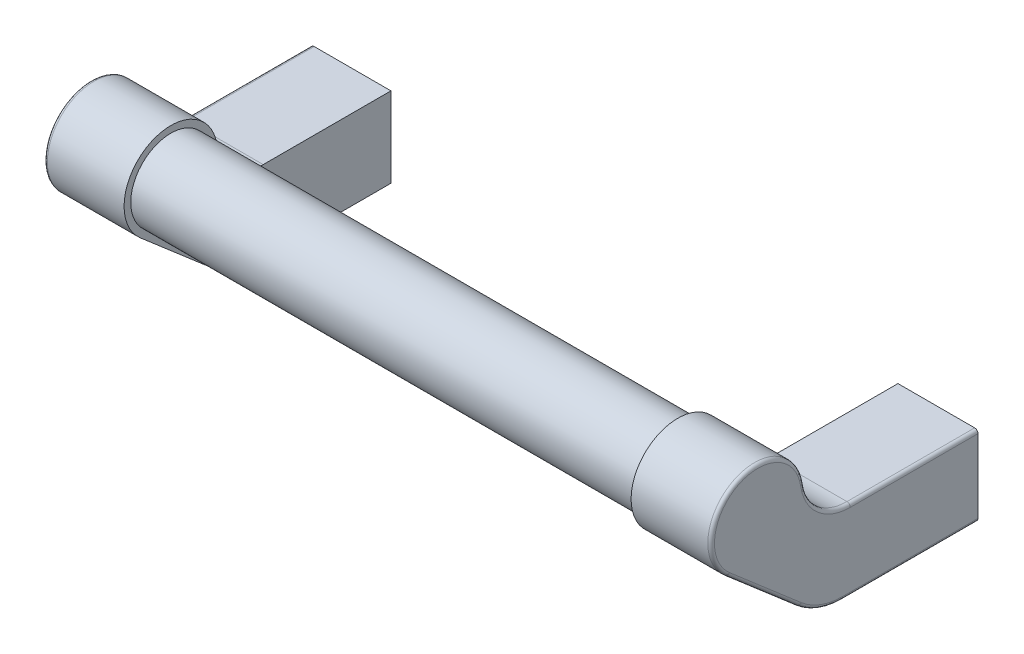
ISO-10303-21;
HEADER;
FILE_DESCRIPTION(('STEP AP214'),'2;1');
FILE_NAME('part.step','',(''),(''),'','','');
FILE_SCHEMA(('AUTOMOTIVE_DESIGN { 1 0 10303 214 1 1 1 1 }'));
ENDSEC;
DATA;
#1=APPLICATION_CONTEXT('core data for automotive mechanical design processes');
#2=APPLICATION_PROTOCOL_DEFINITION('international standard','automotive_design',2000,#1);
#3=PRODUCT_CONTEXT('',#1,'mechanical');
#4=PRODUCT('Part','Part','',(#3));
#5=PRODUCT_RELATED_PRODUCT_CATEGORY('part','',(#4));
#6=PRODUCT_DEFINITION_FORMATION('','',#4);
#7=PRODUCT_DEFINITION_CONTEXT('part definition',#1,'design');
#8=PRODUCT_DEFINITION('design','',#6,#7);
#9=PRODUCT_DEFINITION_SHAPE('','',#8);
#10=(LENGTH_UNIT() NAMED_UNIT(*) SI_UNIT(.MILLI.,.METRE.));
#11=(NAMED_UNIT(*) PLANE_ANGLE_UNIT() SI_UNIT($,.RADIAN.));
#12=(NAMED_UNIT(*) SI_UNIT($,.STERADIAN.) SOLID_ANGLE_UNIT());
#13=UNCERTAINTY_MEASURE_WITH_UNIT(LENGTH_MEASURE(1.E-05),#10,'distance_accuracy_value','');
#14=(GEOMETRIC_REPRESENTATION_CONTEXT(3) GLOBAL_UNCERTAINTY_ASSIGNED_CONTEXT((#13)) GLOBAL_UNIT_ASSIGNED_CONTEXT((#10,
#11,#12)) REPRESENTATION_CONTEXT('',''));
#15=CARTESIAN_POINT('',(0.,0.,0.));
#16=DIRECTION('',(0.,0.,1.));
#17=DIRECTION('',(1.,0.,0.));
#18=AXIS2_PLACEMENT_3D('',#15,#16,#17);
#19=CARTESIAN_POINT('',(94.,-6.,20.284802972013));
#20=DIRECTION('',(0.,1.,0.));
#21=DIRECTION('',(0.,0.,1.));
#22=AXIS2_PLACEMENT_3D('',#19,#20,#21);
#23=PLANE('',#22);
#24=DIRECTION('',(-1.,0.,0.));
#25=VECTOR('',#24,1.);
#26=CARTESIAN_POINT('',(94.,-6.,0.));
#27=LINE('',#26,#25);
#28=CARTESIAN_POINT('',(93.5,-6.,0.));
#29=VERTEX_POINT('',#28);
#30=CARTESIAN_POINT('',(82.,-6.,0.));
#31=VERTEX_POINT('',#30);
#32=EDGE_CURVE('E157',#29,#31,#27,.T.);
#33=ORIENTED_EDGE('',*,*,#32,.F.);
#34=DIRECTION('',(0.,0.,-1.));
#35=VECTOR('',#34,1.);
#36=CARTESIAN_POINT('',(93.5,-6.,20.284802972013));
#37=LINE('',#36,#35);
#38=CARTESIAN_POINT('',(93.5,-6.,20.284802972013));
#39=VERTEX_POINT('',#38);
#40=EDGE_CURVE('E29',#29,#39,#37,.F.);
#41=ORIENTED_EDGE('',*,*,#40,.T.);
#42=DIRECTION('',(-1.,0.,0.));
#43=VECTOR('',#42,1.);
#44=CARTESIAN_POINT('',(94.,-6.,20.284802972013));
#45=LINE('',#44,#43);
#46=CARTESIAN_POINT('',(82.,-6.,20.284802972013));
#47=VERTEX_POINT('',#46);
#48=EDGE_CURVE('E179',#39,#47,#45,.T.);
#49=ORIENTED_EDGE('',*,*,#48,.T.);
#50=DIRECTION('',(0.,0.,-1.));
#51=VECTOR('',#50,1.);
#52=CARTESIAN_POINT('',(82.,-6.,20.284802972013));
#53=LINE('',#52,#51);
#54=EDGE_CURVE('E174',#47,#31,#53,.T.);
#55=ORIENTED_EDGE('',*,*,#54,.T.);
#56=EDGE_LOOP('',(#33,#41,#49,#55));
#57=FACE_BOUND('',#56,.T.);
#58=ADVANCED_FACE('F14',(#57),#23,.F.);
#59=CARTESIAN_POINT('',(94.,-6.,0.));
#60=DIRECTION('',(0.,0.,1.));
#61=DIRECTION('',(1.,0.,0.));
#62=AXIS2_PLACEMENT_3D('',#59,#60,#61);
#63=PLANE('',#62);
#64=CARTESIAN_POINT('',(88.,0.,0.));
#65=DIRECTION('',(0.,0.,1.));
#66=DIRECTION('',(1.,0.,0.));
#67=AXIS2_PLACEMENT_3D('',#64,#65,#66);
#68=CIRCLE('',#67,2.4);
#69=CARTESIAN_POINT('',(90.4,0.,0.));
#70=VERTEX_POINT('',#69);
#71=EDGE_CURVE('E9',#70,#70,#68,.T.);
#72=ORIENTED_EDGE('',*,*,#71,.T.);
#73=EDGE_LOOP('',(#72));
#74=FACE_BOUND('',#73,.T.);
#75=DIRECTION('',(-1.,0.,0.));
#76=VECTOR('',#75,1.);
#77=CARTESIAN_POINT('',(94.,6.,0.));
#78=LINE('',#77,#76);
#79=CARTESIAN_POINT('',(93.5,6.,0.));
#80=VERTEX_POINT('',#79);
#81=CARTESIAN_POINT('',(82.,6.,0.));
#82=VERTEX_POINT('',#81);
#83=EDGE_CURVE('E168',#80,#82,#78,.T.);
#84=ORIENTED_EDGE('',*,*,#83,.F.);
#85=CARTESIAN_POINT('',(93.5,5.5,0.));
#86=DIRECTION('',(0.,0.,1.));
#87=DIRECTION('',(1.,0.,0.));
#88=AXIS2_PLACEMENT_3D('',#85,#86,#87);
#89=CIRCLE('',#88,0.5);
#90=CARTESIAN_POINT('',(94.,5.5,0.));
#91=VERTEX_POINT('',#90);
#92=EDGE_CURVE('E330',#80,#91,#89,.F.);
#93=ORIENTED_EDGE('',*,*,#92,.T.);
#94=DIRECTION('',(0.,1.,0.));
#95=VECTOR('',#94,1.);
#96=CARTESIAN_POINT('',(94.,-6.,0.));
#97=LINE('',#96,#95);
#98=CARTESIAN_POINT('',(94.,-5.5,0.));
#99=VERTEX_POINT('',#98);
#100=EDGE_CURVE('E187',#99,#91,#97,.T.);
#101=ORIENTED_EDGE('',*,*,#100,.F.);
#102=CARTESIAN_POINT('',(93.5,-5.5,0.));
#103=DIRECTION('',(0.,0.,1.));
#104=DIRECTION('',(1.,0.,0.));
#105=AXIS2_PLACEMENT_3D('',#102,#103,#104);
#106=CIRCLE('',#105,0.5);
#107=EDGE_CURVE('E165',#99,#29,#106,.F.);
#108=ORIENTED_EDGE('',*,*,#107,.T.);
#109=ORIENTED_EDGE('',*,*,#32,.T.);
#110=DIRECTION('',(0.,1.,0.));
#111=VECTOR('',#110,1.);
#112=CARTESIAN_POINT('',(82.,-6.,0.));
#113=LINE('',#112,#111);
#114=EDGE_CURVE('E161',#31,#82,#113,.T.);
#115=ORIENTED_EDGE('',*,*,#114,.T.);
#116=EDGE_LOOP('',(#84,#93,#101,#108,#109,#115));
#117=FACE_BOUND('',#116,.T.);
#118=ADVANCED_FACE('F160',(#74,#117),#63,.F.);
#119=CARTESIAN_POINT('',(94.,6.,0.));
#120=DIRECTION('',(0.,-1.,0.));
#121=DIRECTION('',(0.,0.,-1.));
#122=AXIS2_PLACEMENT_3D('',#119,#120,#121);
#123=PLANE('',#122);
#124=DIRECTION('',(-1.,0.,0.));
#125=VECTOR('',#124,1.);
#126=CARTESIAN_POINT('',(94.,6.,19.143593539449));
#127=LINE('',#126,#125);
#128=CARTESIAN_POINT('',(93.5,6.,19.143593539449));
#129=VERTEX_POINT('',#128);
#130=CARTESIAN_POINT('',(82.,6.,19.143593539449));
#131=VERTEX_POINT('',#130);
#132=EDGE_CURVE('E209',#129,#131,#127,.T.);
#133=ORIENTED_EDGE('',*,*,#132,.F.);
#134=DIRECTION('',(0.,0.,1.));
#135=VECTOR('',#134,1.);
#136=CARTESIAN_POINT('',(93.5,6.,0.));
#137=LINE('',#136,#135);
#138=EDGE_CURVE('E327',#129,#80,#137,.F.);
#139=ORIENTED_EDGE('',*,*,#138,.T.);
#140=ORIENTED_EDGE('',*,*,#83,.T.);
#141=DIRECTION('',(0.,0.,1.));
#142=VECTOR('',#141,1.);
#143=CARTESIAN_POINT('',(82.,6.,0.));
#144=LINE('',#143,#142);
#145=EDGE_CURVE('E177',#82,#131,#144,.T.);
#146=ORIENTED_EDGE('',*,*,#145,.T.);
#147=EDGE_LOOP('',(#133,#139,#140,#146));
#148=FACE_BOUND('',#147,.T.);
#149=ADVANCED_FACE('F371',(#148),#123,.F.);
#150=CARTESIAN_POINT('',(94.,13.,19.143593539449));
#151=DIRECTION('',(-1.,0.,0.));
#152=DIRECTION('',(0.,0.,1.));
#153=AXIS2_PLACEMENT_3D('',#150,#151,#152);
#154=CYLINDRICAL_SURFACE('',#153,7.);
#155=DIRECTION('',(-1.,0.,0.));
#156=VECTOR('',#155,1.);
#157=CARTESIAN_POINT('',(94.,12.,26.0717967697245));
#158=LINE('',#157,#156);
#159=CARTESIAN_POINT('',(93.5,12.,26.0717967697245));
#160=VERTEX_POINT('',#159);
#161=CARTESIAN_POINT('',(82.,12.,26.0717967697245));
#162=VERTEX_POINT('',#161);
#163=EDGE_CURVE('E207',#160,#162,#158,.T.);
#164=ORIENTED_EDGE('',*,*,#163,.F.);
#165=CARTESIAN_POINT('',(93.5,13.,19.143593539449));
#166=DIRECTION('',(1.,0.,0.));
#167=DIRECTION('',(0.,0.,-1.));
#168=AXIS2_PLACEMENT_3D('',#165,#166,#167);
#169=CIRCLE('',#168,7.);
#170=EDGE_CURVE('E332',#160,#129,#169,.T.);
#171=ORIENTED_EDGE('',*,*,#170,.T.);
#172=ORIENTED_EDGE('',*,*,#132,.T.);
#173=CARTESIAN_POINT('',(82.,13.,19.143593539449));
#174=DIRECTION('',(-1.,0.,0.));
#175=DIRECTION('',(0.,0.,-1.));
#176=AXIS2_PLACEMENT_3D('',#173,#174,#175);
#177=CIRCLE('',#176,7.);
#178=EDGE_CURVE('E191',#131,#162,#177,.T.);
#179=ORIENTED_EDGE('',*,*,#178,.T.);
#180=EDGE_LOOP('',(#164,#171,#172,#179));
#181=FACE_BOUND('',#180,.T.);
#182=ADVANCED_FACE('F606',(#181),#154,.F.);
#183=CARTESIAN_POINT('',(94.,11.,33.));
#184=DIRECTION('',(-1.,0.,0.));
#185=DIRECTION('',(0.,0.,1.));
#186=AXIS2_PLACEMENT_3D('',#183,#184,#185);
#187=CYLINDRICAL_SURFACE('',#186,7.);
#188=DIRECTION('',(-1.,0.,0.));
#189=VECTOR('',#188,1.);
#190=CARTESIAN_POINT('',(94.,5.69800597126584,37.5704331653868));
#191=LINE('',#190,#189);
#192=CARTESIAN_POINT('',(93.5,5.69800597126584,37.5704331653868));
#193=VERTEX_POINT('',#192);
#194=CARTESIAN_POINT('',(82.,5.69800597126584,37.5704331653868));
#195=VERTEX_POINT('',#194);
#196=EDGE_CURVE('E205',#193,#195,#191,.T.);
#197=ORIENTED_EDGE('',*,*,#196,.F.);
#198=CARTESIAN_POINT('',(93.5,11.,33.));
#199=DIRECTION('',(1.,0.,0.));
#200=DIRECTION('',(0.,0.,-1.));
#201=AXIS2_PLACEMENT_3D('',#198,#199,#200);
#202=CIRCLE('',#201,7.);
#203=EDGE_CURVE('E334',#193,#160,#202,.F.);
#204=ORIENTED_EDGE('',*,*,#203,.T.);
#205=ORIENTED_EDGE('',*,*,#163,.T.);
#206=CARTESIAN_POINT('',(82.,11.,33.));
#207=DIRECTION('',(1.,0.,0.));
#208=DIRECTION('',(0.,0.,-1.));
#209=AXIS2_PLACEMENT_3D('',#206,#207,#208);
#210=CIRCLE('',#209,7.);
#211=EDGE_CURVE('E194',#162,#195,#210,.T.);
#212=ORIENTED_EDGE('',*,*,#211,.T.);
#213=EDGE_LOOP('',(#197,#204,#205,#212));
#214=FACE_BOUND('',#213,.T.);
#215=ADVANCED_FACE('F598',(#214),#187,.T.);
#216=CARTESIAN_POINT('',(94.,5.69800597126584,37.5704331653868));
#217=DIRECTION('',(0.,0.757427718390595,-0.65291902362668));
#218=DIRECTION('',(0.,0.65291902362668,0.757427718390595));
#219=AXIS2_PLACEMENT_3D('',#216,#217,#218);
#220=PLANE('',#219);
#221=DIRECTION('',(-1.,0.,0.));
#222=VECTOR('',#221,1.);
#223=CARTESIAN_POINT('',(94.,-3.57427718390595,26.8139932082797));
#224=LINE('',#223,#222);
#225=CARTESIAN_POINT('',(93.5,-3.57427718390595,26.8139932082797));
#226=VERTEX_POINT('',#225);
#227=CARTESIAN_POINT('',(82.,-3.57427718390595,26.8139932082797));
#228=VERTEX_POINT('',#227);
#229=EDGE_CURVE('E203',#226,#228,#224,.T.);
#230=ORIENTED_EDGE('',*,*,#229,.F.);
#231=DIRECTION('',(0.,-0.65291902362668,-0.757427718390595));
#232=VECTOR('',#231,1.);
#233=CARTESIAN_POINT('',(93.5,5.69800597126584,37.5704331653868));
#234=LINE('',#233,#232);
#235=EDGE_CURVE('E336',#226,#193,#234,.F.);
#236=ORIENTED_EDGE('',*,*,#235,.T.);
#237=ORIENTED_EDGE('',*,*,#196,.T.);
#238=DIRECTION('',(0.,-0.65291902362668,-0.757427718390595));
#239=VECTOR('',#238,1.);
#240=CARTESIAN_POINT('',(82.,5.69800597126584,37.5704331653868));
#241=LINE('',#240,#239);
#242=EDGE_CURVE('E197',#195,#228,#241,.T.);
#243=ORIENTED_EDGE('',*,*,#242,.T.);
#244=EDGE_LOOP('',(#230,#236,#237,#243));
#245=FACE_BOUND('',#244,.T.);
#246=ADVANCED_FACE('F591',(#245),#220,.F.);
#247=CARTESIAN_POINT('',(94.,4.,20.284802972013));
#248=DIRECTION('',(-1.,0.,0.));
#249=DIRECTION('',(0.,0.,1.));
#250=AXIS2_PLACEMENT_3D('',#247,#248,#249);
#251=CYLINDRICAL_SURFACE('',#250,10.);
#252=ORIENTED_EDGE('',*,*,#48,.F.);
#253=CARTESIAN_POINT('',(93.5,4.,20.284802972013));
#254=DIRECTION('',(1.,0.,0.));
#255=DIRECTION('',(0.,0.,-1.));
#256=AXIS2_PLACEMENT_3D('',#253,#254,#255);
#257=CIRCLE('',#256,10.);
#258=EDGE_CURVE('E36',#39,#226,#257,.F.);
#259=ORIENTED_EDGE('',*,*,#258,.T.);
#260=ORIENTED_EDGE('',*,*,#229,.T.);
#261=CARTESIAN_POINT('',(82.,4.,20.284802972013));
#262=DIRECTION('',(1.,0.,0.));
#263=DIRECTION('',(0.,0.,-1.));
#264=AXIS2_PLACEMENT_3D('',#261,#262,#263);
#265=CIRCLE('',#264,10.);
#266=EDGE_CURVE('E200',#228,#47,#265,.T.);
#267=ORIENTED_EDGE('',*,*,#266,.T.);
#268=EDGE_LOOP('',(#252,#259,#260,#267));
#269=FACE_BOUND('',#268,.T.);
#270=ADVANCED_FACE('F583',(#269),#251,.T.);
#271=CARTESIAN_POINT('',(94.,13.,19.143593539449));
#272=DIRECTION('',(1.,0.,0.));
#273=DIRECTION('',(0.,0.,-1.));
#274=AXIS2_PLACEMENT_3D('',#271,#272,#273);
#275=PLANE('',#274);
#276=ORIENTED_EDGE('',*,*,#100,.T.);
#277=DIRECTION('',(0.,0.,1.));
#278=VECTOR('',#277,1.);
#279=CARTESIAN_POINT('',(94.,5.5,19.143593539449));
#280=LINE('',#279,#278);
#281=CARTESIAN_POINT('',(94.,5.5,19.143593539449));
#282=VERTEX_POINT('',#281);
#283=EDGE_CURVE('E324',#91,#282,#280,.T.);
#284=ORIENTED_EDGE('',*,*,#283,.T.);
#285=CARTESIAN_POINT('',(94.,13.,19.143593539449));
#286=DIRECTION('',(1.,0.,0.));
#287=DIRECTION('',(0.,0.,-1.));
#288=AXIS2_PLACEMENT_3D('',#285,#286,#287);
#289=CIRCLE('',#288,7.5);
#290=CARTESIAN_POINT('',(94.,11.9285714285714,26.5666684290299));
#291=VERTEX_POINT('',#290);
#292=EDGE_CURVE('E322',#282,#291,#289,.F.);
#293=ORIENTED_EDGE('',*,*,#292,.T.);
#294=CARTESIAN_POINT('',(94.,11.,33.));
#295=DIRECTION('',(1.,0.,0.));
#296=DIRECTION('',(0.,0.,-1.));
#297=AXIS2_PLACEMENT_3D('',#294,#295,#296);
#298=CIRCLE('',#297,6.5);
#299=CARTESIAN_POINT('',(94.,6.07671983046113,37.2439736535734));
#300=VERTEX_POINT('',#299);
#301=EDGE_CURVE('E320',#291,#300,#298,.T.);
#302=ORIENTED_EDGE('',*,*,#301,.T.);
#303=DIRECTION('',(0.,-0.65291902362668,-0.757427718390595));
#304=VECTOR('',#303,1.);
#305=CARTESIAN_POINT('',(94.,-3.19556332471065,26.4875336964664));
#306=LINE('',#305,#304);
#307=CARTESIAN_POINT('',(94.,-3.19556332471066,26.4875336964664));
#308=VERTEX_POINT('',#307);
#309=EDGE_CURVE('E318',#300,#308,#306,.T.);
#310=ORIENTED_EDGE('',*,*,#309,.T.);
#311=CARTESIAN_POINT('',(94.,4.,20.284802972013));
#312=DIRECTION('',(1.,0.,0.));
#313=DIRECTION('',(0.,0.,-1.));
#314=AXIS2_PLACEMENT_3D('',#311,#312,#313);
#315=CIRCLE('',#314,9.5);
#316=CARTESIAN_POINT('',(94.,-5.5,20.284802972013));
#317=VERTEX_POINT('',#316);
#318=EDGE_CURVE('E316',#308,#317,#315,.T.);
#319=ORIENTED_EDGE('',*,*,#318,.T.);
#320=DIRECTION('',(0.,0.,-1.));
#321=VECTOR('',#320,1.);
#322=CARTESIAN_POINT('',(94.,-5.5,0.));
#323=LINE('',#322,#321);
#324=EDGE_CURVE('E312',#317,#99,#323,.T.);
#325=ORIENTED_EDGE('',*,*,#324,.T.);
#326=EDGE_LOOP('',(#276,#284,#293,#302,#310,#319,#325));
#327=FACE_BOUND('',#326,.T.);
#328=ADVANCED_FACE('F575',(#327),#275,.T.);
#329=CARTESIAN_POINT('',(82.,13.,19.143593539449));
#330=DIRECTION('',(1.,0.,0.));
#331=DIRECTION('',(0.,0.,-1.));
#332=AXIS2_PLACEMENT_3D('',#329,#330,#331);
#333=PLANE('',#332);
#334=CARTESIAN_POINT('',(82.,11.,33.));
#335=DIRECTION('',(1.,0.,0.));
#336=DIRECTION('',(0.,0.,-1.));
#337=AXIS2_PLACEMENT_3D('',#334,#335,#336);
#338=CIRCLE('',#337,6.);
#339=CARTESIAN_POINT('',(82.,11.,27.));
#340=VERTEX_POINT('',#339);
#341=EDGE_CURVE('E167',#340,#340,#338,.F.);
#342=ORIENTED_EDGE('',*,*,#341,.F.);
#343=EDGE_LOOP('',(#342));
#344=FACE_BOUND('',#343,.T.);
#345=ORIENTED_EDGE('',*,*,#54,.F.);
#346=ORIENTED_EDGE('',*,*,#266,.F.);
#347=ORIENTED_EDGE('',*,*,#242,.F.);
#348=ORIENTED_EDGE('',*,*,#211,.F.);
#349=ORIENTED_EDGE('',*,*,#178,.F.);
#350=ORIENTED_EDGE('',*,*,#145,.F.);
#351=ORIENTED_EDGE('',*,*,#114,.F.);
#352=EDGE_LOOP('',(#345,#346,#347,#348,#349,#350,#351));
#353=FACE_BOUND('',#352,.T.);
#354=ADVANCED_FACE('F172',(#344,#353),#333,.F.);
#355=CARTESIAN_POINT('',(0.,0.,6.));
#356=DIRECTION('',(0.,0.,-1.));
#357=DIRECTION('',(-1.,0.,0.));
#358=AXIS2_PLACEMENT_3D('',#355,#356,#357);
#359=PLANE('',#358);
#360=CARTESIAN_POINT('',(0.,0.,6.));
#361=DIRECTION('',(0.,0.,-1.));
#362=DIRECTION('',(-1.,0.,0.));
#363=AXIS2_PLACEMENT_3D('',#360,#361,#362);
#364=CIRCLE('',#363,2.);
#365=CARTESIAN_POINT('',(-2.,0.,6.));
#366=VERTEX_POINT('',#365);
#367=EDGE_CURVE('E218',#366,#366,#364,.T.);
#368=ORIENTED_EDGE('',*,*,#367,.T.);
#369=EDGE_LOOP('',(#368));
#370=FACE_BOUND('',#369,.T.);
#371=ADVANCED_FACE('F560',(#370),#359,.T.);
#372=CARTESIAN_POINT('',(0.,0.,6.));
#373=DIRECTION('',(0.,0.,-1.));
#374=DIRECTION('',(-1.,0.,0.));
#375=AXIS2_PLACEMENT_3D('',#372,#373,#374);
#376=CYLINDRICAL_SURFACE('',#375,2.);
#377=CARTESIAN_POINT('',(0.,0.,0.4));
#378=DIRECTION('',(0.,0.,1.));
#379=DIRECTION('',(1.,0.,0.));
#380=AXIS2_PLACEMENT_3D('',#377,#378,#379);
#381=CIRCLE('',#380,2.);
#382=CARTESIAN_POINT('',(2.,0.,0.4));
#383=VERTEX_POINT('',#382);
#384=EDGE_CURVE('E306',#383,#383,#381,.F.);
#385=ORIENTED_EDGE('',*,*,#384,.T.);
#386=EDGE_LOOP('',(#385));
#387=FACE_BOUND('',#386,.T.);
#388=ORIENTED_EDGE('',*,*,#367,.F.);
#389=EDGE_LOOP('',(#388));
#390=FACE_BOUND('',#389,.T.);
#391=ADVANCED_FACE('F475',(#387,#390),#376,.F.);
#392=CARTESIAN_POINT('',(-5.5,4.,20.284802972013));
#393=DIRECTION('',(-1.,0.,0.));
#394=DIRECTION('',(0.,-1.,0.));
#395=AXIS2_PLACEMENT_3D('',#392,#393,#394);
#396=TOROIDAL_SURFACE('',#395,9.5,0.5);
#397=CARTESIAN_POINT('',(-5.5,-3.19556332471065,26.4875336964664));
#398=DIRECTION('',(0.,0.65291902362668,0.757427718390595));
#399=DIRECTION('',(0.,-0.757427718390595,0.65291902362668));
#400=AXIS2_PLACEMENT_3D('',#397,#398,#399);
#401=CIRCLE('',#400,0.5);
#402=CARTESIAN_POINT('',(-6.,-3.19556332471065,26.4875336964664));
#403=VERTEX_POINT('',#402);
#404=CARTESIAN_POINT('',(-5.5,-3.57427718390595,26.8139932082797));
#405=VERTEX_POINT('',#404);
#406=EDGE_CURVE('E260',#403,#405,#401,.T.);
#407=ORIENTED_EDGE('',*,*,#406,.F.);
#408=CARTESIAN_POINT('',(-6.,4.,20.284802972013));
#409=DIRECTION('',(1.,0.,0.));
#410=DIRECTION('',(0.,-0.757427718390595,0.65291902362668));
#411=AXIS2_PLACEMENT_3D('',#408,#409,#410);
#412=CIRCLE('',#411,9.50000000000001);
#413=CARTESIAN_POINT('',(-6.,-5.5,20.284802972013));
#414=VERTEX_POINT('',#413);
#415=EDGE_CURVE('E406',#414,#403,#412,.F.);
#416=ORIENTED_EDGE('',*,*,#415,.F.);
#417=CARTESIAN_POINT('',(-5.5,-5.5,20.284802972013));
#418=DIRECTION('',(0.,0.,1.));
#419=DIRECTION('',(0.,-1.,0.));
#420=AXIS2_PLACEMENT_3D('',#417,#418,#419);
#421=CIRCLE('',#420,0.5);
#422=CARTESIAN_POINT('',(-5.5,-6.,20.284802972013));
#423=VERTEX_POINT('',#422);
#424=EDGE_CURVE('E254',#414,#423,#421,.T.);
#425=ORIENTED_EDGE('',*,*,#424,.T.);
#426=CARTESIAN_POINT('',(-5.5,4.,20.284802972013));
#427=DIRECTION('',(-1.,0.,0.));
#428=DIRECTION('',(0.,-1.,0.));
#429=AXIS2_PLACEMENT_3D('',#426,#427,#428);
#430=CIRCLE('',#429,10.);
#431=EDGE_CURVE('E257',#423,#405,#430,.T.);
#432=ORIENTED_EDGE('',*,*,#431,.T.);
#433=EDGE_LOOP('',(#407,#416,#425,#432));
#434=FACE_BOUND('',#433,.T.);
#435=ADVANCED_FACE('F464',(#434),#396,.T.);
#436=CARTESIAN_POINT('',(-5.5,-3.19556332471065,26.4875336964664));
#437=DIRECTION('',(0.,0.65291902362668,0.757427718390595));
#438=DIRECTION('',(0.,-0.757427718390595,0.65291902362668));
#439=AXIS2_PLACEMENT_3D('',#436,#437,#438);
#440=CYLINDRICAL_SURFACE('',#439,0.5);
#441=CARTESIAN_POINT('',(-5.5,6.07671983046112,37.2439736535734));
#442=DIRECTION('',(0.,0.652919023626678,0.757427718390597));
#443=DIRECTION('',(0.,-0.757427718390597,0.652919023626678));
#444=AXIS2_PLACEMENT_3D('',#441,#442,#443);
#445=CIRCLE('',#444,0.5);
#446=CARTESIAN_POINT('',(-6.,6.07671983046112,37.2439736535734));
#447=VERTEX_POINT('',#446);
#448=CARTESIAN_POINT('',(-5.5,5.69800597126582,37.5704331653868));
#449=VERTEX_POINT('',#448);
#450=EDGE_CURVE('E266',#447,#449,#445,.T.);
#451=ORIENTED_EDGE('',*,*,#450,.F.);
#452=DIRECTION('',(0.,0.65291902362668,0.757427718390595));
#453=VECTOR('',#452,1.);
#454=CARTESIAN_POINT('',(-6.,-3.19556332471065,26.4875336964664));
#455=LINE('',#454,#453);
#456=EDGE_CURVE('E408',#403,#447,#455,.T.);
#457=ORIENTED_EDGE('',*,*,#456,.F.);
#458=ORIENTED_EDGE('',*,*,#406,.T.);
#459=DIRECTION('',(0.,0.65291902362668,0.757427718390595));
#460=VECTOR('',#459,1.);
#461=CARTESIAN_POINT('',(-5.5,-3.57427718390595,26.8139932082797));
#462=LINE('',#461,#460);
#463=EDGE_CURVE('E263',#405,#449,#462,.T.);
#464=ORIENTED_EDGE('',*,*,#463,.T.);
#465=EDGE_LOOP('',(#451,#457,#458,#464));
#466=FACE_BOUND('',#465,.T.);
#467=ADVANCED_FACE('F474',(#466),#440,.T.);
#468=CARTESIAN_POINT('',(-5.5,11.,33.));
#469=DIRECTION('',(-1.,0.,0.));
#470=DIRECTION('',(0.,-1.,0.));
#471=AXIS2_PLACEMENT_3D('',#468,#469,#470);
#472=TOROIDAL_SURFACE('',#471,6.5,0.5);
#473=CARTESIAN_POINT('',(-5.5,11.9285714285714,26.5666684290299));
#474=DIRECTION('',(0.,-0.989743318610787,-0.142857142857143));
#475=DIRECTION('',(0.,0.142857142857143,-0.989743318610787));
#476=AXIS2_PLACEMENT_3D('',#473,#474,#475);
#477=CIRCLE('',#476,0.5);
#478=CARTESIAN_POINT('',(-5.5,12.,26.0717967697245));
#479=VERTEX_POINT('',#478);
#480=CARTESIAN_POINT('',(-6.,11.9285714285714,26.5666684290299));
#481=VERTEX_POINT('',#480);
#482=EDGE_CURVE('E274',#479,#481,#477,.F.);
#483=ORIENTED_EDGE('',*,*,#482,.T.);
#484=CARTESIAN_POINT('',(-6.,11.,33.));
#485=DIRECTION('',(1.,0.,0.));
#486=DIRECTION('',(0.,0.142857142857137,-0.989743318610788));
#487=AXIS2_PLACEMENT_3D('',#484,#485,#486);
#488=CIRCLE('',#487,6.50000000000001);
#489=EDGE_CURVE('E215',#447,#481,#488,.F.);
#490=ORIENTED_EDGE('',*,*,#489,.F.);
#491=ORIENTED_EDGE('',*,*,#450,.T.);
#492=CARTESIAN_POINT('',(-5.5,11.,33.));
#493=DIRECTION('',(-1.,0.,0.));
#494=DIRECTION('',(0.,-1.,0.));
#495=AXIS2_PLACEMENT_3D('',#492,#493,#494);
#496=CIRCLE('',#495,7.);
#497=EDGE_CURVE('E271',#449,#479,#496,.T.);
#498=ORIENTED_EDGE('',*,*,#497,.T.);
#499=EDGE_LOOP('',(#483,#490,#491,#498));
#500=FACE_BOUND('',#499,.T.);
#501=ADVANCED_FACE('F294',(#500),#472,.T.);
#502=CARTESIAN_POINT('',(-5.5,13.,19.143593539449));
#503=DIRECTION('',(-1.,0.,0.));
#504=DIRECTION('',(0.,-1.,0.));
#505=AXIS2_PLACEMENT_3D('',#502,#503,#504);
#506=TOROIDAL_SURFACE('',#505,7.5,0.5);
#507=CARTESIAN_POINT('',(-5.5,5.5,19.143593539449));
#508=DIRECTION('',(0.,0.,-1.));
#509=DIRECTION('',(-1.,0.,0.));
#510=AXIS2_PLACEMENT_3D('',#507,#508,#509);
#511=CIRCLE('',#510,0.5);
#512=CARTESIAN_POINT('',(-6.,5.5,19.143593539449));
#513=VERTEX_POINT('',#512);
#514=CARTESIAN_POINT('',(-5.5,6.,19.143593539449));
#515=VERTEX_POINT('',#514);
#516=EDGE_CURVE('E251',#513,#515,#511,.T.);
#517=ORIENTED_EDGE('',*,*,#516,.F.);
#518=CARTESIAN_POINT('',(-6.,13.,19.143593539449));
#519=DIRECTION('',(-1.,0.,0.));
#520=DIRECTION('',(0.,-1.,0.));
#521=AXIS2_PLACEMENT_3D('',#518,#519,#520);
#522=CIRCLE('',#521,7.5);
#523=EDGE_CURVE('E433',#481,#513,#522,.F.);
#524=ORIENTED_EDGE('',*,*,#523,.F.);
#525=ORIENTED_EDGE('',*,*,#482,.F.);
#526=CARTESIAN_POINT('',(-5.5,13.,19.143593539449));
#527=DIRECTION('',(-1.,0.,0.));
#528=DIRECTION('',(0.,-1.,0.));
#529=AXIS2_PLACEMENT_3D('',#526,#527,#528);
#530=CIRCLE('',#529,7.);
#531=EDGE_CURVE('E229',#479,#515,#530,.F.);
#532=ORIENTED_EDGE('',*,*,#531,.T.);
#533=EDGE_LOOP('',(#517,#524,#525,#532));
#534=FACE_BOUND('',#533,.T.);
#535=ADVANCED_FACE('F282',(#534),#506,.T.);
#536=CARTESIAN_POINT('',(-6.,13.,19.143593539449));
#537=DIRECTION('',(-1.,0.,0.));
#538=DIRECTION('',(0.,-1.,0.));
#539=AXIS2_PLACEMENT_3D('',#536,#537,#538);
#540=PLANE('',#539);
#541=ORIENTED_EDGE('',*,*,#456,.T.);
#542=ORIENTED_EDGE('',*,*,#489,.T.);
#543=ORIENTED_EDGE('',*,*,#523,.T.);
#544=DIRECTION('',(0.,0.,1.));
#545=VECTOR('',#544,1.);
#546=CARTESIAN_POINT('',(-6.,5.5,19.143593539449));
#547=LINE('',#546,#545);
#548=CARTESIAN_POINT('',(-6.,5.5,0.));
#549=VERTEX_POINT('',#548);
#550=EDGE_CURVE('E430',#513,#549,#547,.F.);
#551=ORIENTED_EDGE('',*,*,#550,.T.);
#552=DIRECTION('',(0.,-1.,0.));
#553=VECTOR('',#552,1.);
#554=CARTESIAN_POINT('',(-6.,13.,0.));
#555=LINE('',#554,#553);
#556=CARTESIAN_POINT('',(-6.,-5.5,0.));
#557=VERTEX_POINT('',#556);
#558=EDGE_CURVE('E415',#549,#557,#555,.T.);
#559=ORIENTED_EDGE('',*,*,#558,.T.);
#560=DIRECTION('',(0.,0.,1.));
#561=VECTOR('',#560,1.);
#562=CARTESIAN_POINT('',(-6.,-5.5,19.143593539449));
#563=LINE('',#562,#561);
#564=EDGE_CURVE('E411',#557,#414,#563,.T.);
#565=ORIENTED_EDGE('',*,*,#564,.T.);
#566=ORIENTED_EDGE('',*,*,#415,.T.);
#567=EDGE_LOOP('',(#541,#542,#543,#551,#559,#565,#566));
#568=FACE_BOUND('',#567,.T.);
#569=ADVANCED_FACE('F293',(#568),#540,.T.);
#570=CARTESIAN_POINT('',(-5.5,-5.5,20.284802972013));
#571=DIRECTION('',(0.,0.,1.));
#572=DIRECTION('',(1.,0.,0.));
#573=AXIS2_PLACEMENT_3D('',#570,#571,#572);
#574=CYLINDRICAL_SURFACE('',#573,0.5);
#575=ORIENTED_EDGE('',*,*,#424,.F.);
#576=ORIENTED_EDGE('',*,*,#564,.F.);
#577=CARTESIAN_POINT('',(-5.5,-5.5,0.));
#578=DIRECTION('',(0.,0.,1.));
#579=DIRECTION('',(1.,0.,0.));
#580=AXIS2_PLACEMENT_3D('',#577,#578,#579);
#581=CIRCLE('',#580,0.5);
#582=CARTESIAN_POINT('',(-5.5,-6.,0.));
#583=VERTEX_POINT('',#582);
#584=EDGE_CURVE('E233',#557,#583,#581,.T.);
#585=ORIENTED_EDGE('',*,*,#584,.T.);
#586=DIRECTION('',(0.,0.,1.));
#587=VECTOR('',#586,1.);
#588=CARTESIAN_POINT('',(-5.5,-6.,20.284802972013));
#589=LINE('',#588,#587);
#590=EDGE_CURVE('E236',#583,#423,#589,.T.);
#591=ORIENTED_EDGE('',*,*,#590,.T.);
#592=EDGE_LOOP('',(#575,#576,#585,#591));
#593=FACE_BOUND('',#592,.T.);
#594=ADVANCED_FACE('F379',(#593),#574,.T.);
#595=CARTESIAN_POINT('',(-5.5,5.5,0.));
#596=DIRECTION('',(0.,0.,-1.));
#597=DIRECTION('',(-1.,0.,0.));
#598=AXIS2_PLACEMENT_3D('',#595,#596,#597);
#599=CYLINDRICAL_SURFACE('',#598,0.5);
#600=ORIENTED_EDGE('',*,*,#516,.T.);
#601=DIRECTION('',(0.,0.,-1.));
#602=VECTOR('',#601,1.);
#603=CARTESIAN_POINT('',(-5.5,6.,0.));
#604=LINE('',#603,#602);
#605=CARTESIAN_POINT('',(-5.5,6.,0.));
#606=VERTEX_POINT('',#605);
#607=EDGE_CURVE('E248',#515,#606,#604,.T.);
#608=ORIENTED_EDGE('',*,*,#607,.T.);
#609=CARTESIAN_POINT('',(-5.5,5.5,0.));
#610=DIRECTION('',(0.,0.,-1.));
#611=DIRECTION('',(-1.,0.,0.));
#612=AXIS2_PLACEMENT_3D('',#609,#610,#611);
#613=CIRCLE('',#612,0.5);
#614=EDGE_CURVE('E230',#606,#549,#613,.F.);
#615=ORIENTED_EDGE('',*,*,#614,.T.);
#616=ORIENTED_EDGE('',*,*,#550,.F.);
#617=EDGE_LOOP('',(#600,#608,#615,#616));
#618=FACE_BOUND('',#617,.T.);
#619=ADVANCED_FACE('F296',(#618),#599,.T.);
#620=CARTESIAN_POINT('',(0.,0.,0.4));
#621=DIRECTION('',(0.,0.,-1.));
#622=DIRECTION('',(-1.,0.,0.));
#623=AXIS2_PLACEMENT_3D('',#620,#621,#622);
#624=CONICAL_SURFACE('',#623,2.,0.785398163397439);
#625=CARTESIAN_POINT('',(0.,0.,0.));
#626=DIRECTION('',(0.,0.,1.));
#627=DIRECTION('',(1.,0.,0.));
#628=AXIS2_PLACEMENT_3D('',#625,#626,#627);
#629=CIRCLE('',#628,2.4);
#630=CARTESIAN_POINT('',(2.4,0.,0.));
#631=VERTEX_POINT('',#630);
#632=EDGE_CURVE('E309',#631,#631,#629,.T.);
#633=ORIENTED_EDGE('',*,*,#632,.F.);
#634=EDGE_LOOP('',(#633));
#635=FACE_BOUND('',#634,.T.);
#636=ORIENTED_EDGE('',*,*,#384,.F.);
#637=EDGE_LOOP('',(#636));
#638=FACE_BOUND('',#637,.T.);
#639=ADVANCED_FACE('F521',(#635,#638),#624,.F.);
#640=CARTESIAN_POINT('',(6.,-6.,20.284802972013));
#641=DIRECTION('',(0.,1.,0.));
#642=DIRECTION('',(-1.,0.,0.));
#643=AXIS2_PLACEMENT_3D('',#640,#641,#642);
#644=PLANE('',#643);
#645=ORIENTED_EDGE('',*,*,#590,.F.);
#646=DIRECTION('',(1.,0.,0.));
#647=VECTOR('',#646,1.);
#648=CARTESIAN_POINT('',(6.,-6.,0.));
#649=LINE('',#648,#647);
#650=CARTESIAN_POINT('',(6.,-6.,0.));
#651=VERTEX_POINT('',#650);
#652=EDGE_CURVE('E245',#583,#651,#649,.T.);
#653=ORIENTED_EDGE('',*,*,#652,.T.);
#654=DIRECTION('',(0.,0.,1.));
#655=VECTOR('',#654,1.);
#656=CARTESIAN_POINT('',(6.,-6.,20.284802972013));
#657=LINE('',#656,#655);
#658=CARTESIAN_POINT('',(6.,-6.,20.284802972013));
#659=VERTEX_POINT('',#658);
#660=EDGE_CURVE('E241',#659,#651,#657,.F.);
#661=ORIENTED_EDGE('',*,*,#660,.F.);
#662=DIRECTION('',(-1.,0.,0.));
#663=VECTOR('',#662,1.);
#664=CARTESIAN_POINT('',(6.,-6.,20.284802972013));
#665=LINE('',#664,#663);
#666=EDGE_CURVE('E223',#423,#659,#665,.F.);
#667=ORIENTED_EDGE('',*,*,#666,.F.);
#668=EDGE_LOOP('',(#645,#653,#661,#667));
#669=FACE_BOUND('',#668,.T.);
#670=ADVANCED_FACE('F482',(#669),#644,.F.);
#671=CARTESIAN_POINT('',(6.,4.,20.284802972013));
#672=DIRECTION('',(-1.,0.,0.));
#673=DIRECTION('',(0.,-1.,0.));
#674=AXIS2_PLACEMENT_3D('',#671,#672,#673);
#675=CYLINDRICAL_SURFACE('',#674,10.);
#676=ORIENTED_EDGE('',*,*,#666,.T.);
#677=CARTESIAN_POINT('',(6.,4.,20.284802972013));
#678=DIRECTION('',(-1.,0.,0.));
#679=DIRECTION('',(0.,-1.,0.));
#680=AXIS2_PLACEMENT_3D('',#677,#678,#679);
#681=CIRCLE('',#680,10.);
#682=CARTESIAN_POINT('',(6.,-3.57427718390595,26.8139932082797));
#683=VERTEX_POINT('',#682);
#684=EDGE_CURVE('E220',#659,#683,#681,.T.);
#685=ORIENTED_EDGE('',*,*,#684,.T.);
#686=DIRECTION('',(1.,0.,0.));
#687=VECTOR('',#686,1.);
#688=CARTESIAN_POINT('',(6.,-3.57427718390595,26.8139932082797));
#689=LINE('',#688,#687);
#690=EDGE_CURVE('E238',#683,#405,#689,.F.);
#691=ORIENTED_EDGE('',*,*,#690,.T.);
#692=ORIENTED_EDGE('',*,*,#431,.F.);
#693=EDGE_LOOP('',(#676,#685,#691,#692));
#694=FACE_BOUND('',#693,.T.);
#695=ADVANCED_FACE('F508',(#694),#675,.T.);
#696=CARTESIAN_POINT('',(6.,-3.57427718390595,26.8139932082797));
#697=DIRECTION('',(0.,0.757427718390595,-0.65291902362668));
#698=DIRECTION('',(0.,0.65291902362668,0.757427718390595));
#699=AXIS2_PLACEMENT_3D('',#696,#697,#698);
#700=PLANE('',#699);
#701=ORIENTED_EDGE('',*,*,#463,.F.);
#702=ORIENTED_EDGE('',*,*,#690,.F.);
#703=DIRECTION('',(0.,0.65291902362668,0.757427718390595));
#704=VECTOR('',#703,1.);
#705=CARTESIAN_POINT('',(6.,-3.57427718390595,26.8139932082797));
#706=LINE('',#705,#704);
#707=CARTESIAN_POINT('',(6.,5.69800597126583,37.5704331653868));
#708=VERTEX_POINT('',#707);
#709=EDGE_CURVE('E224',#708,#683,#706,.F.);
#710=ORIENTED_EDGE('',*,*,#709,.F.);
#711=DIRECTION('',(-1.,0.,0.));
#712=VECTOR('',#711,1.);
#713=CARTESIAN_POINT('',(6.,5.69800597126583,37.5704331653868));
#714=LINE('',#713,#712);
#715=EDGE_CURVE('E228',#449,#708,#714,.F.);
#716=ORIENTED_EDGE('',*,*,#715,.F.);
#717=EDGE_LOOP('',(#701,#702,#710,#716));
#718=FACE_BOUND('',#717,.T.);
#719=ADVANCED_FACE('F511',(#718),#700,.F.);
#720=CARTESIAN_POINT('',(6.,11.,33.));
#721=DIRECTION('',(-1.,0.,0.));
#722=DIRECTION('',(0.,-1.,0.));
#723=AXIS2_PLACEMENT_3D('',#720,#721,#722);
#724=CYLINDRICAL_SURFACE('',#723,7.);
#725=ORIENTED_EDGE('',*,*,#715,.T.);
#726=CARTESIAN_POINT('',(6.,11.,33.));
#727=DIRECTION('',(-1.,0.,0.));
#728=DIRECTION('',(0.,-1.,0.));
#729=AXIS2_PLACEMENT_3D('',#726,#727,#728);
#730=CIRCLE('',#729,7.);
#731=CARTESIAN_POINT('',(6.,12.,26.0717967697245));
#732=VERTEX_POINT('',#731);
#733=EDGE_CURVE('E225',#708,#732,#730,.T.);
#734=ORIENTED_EDGE('',*,*,#733,.T.);
#735=DIRECTION('',(-1.,0.,0.));
#736=VECTOR('',#735,1.);
#737=CARTESIAN_POINT('',(6.,12.,26.0717967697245));
#738=LINE('',#737,#736);
#739=EDGE_CURVE('E262',#732,#479,#738,.T.);
#740=ORIENTED_EDGE('',*,*,#739,.T.);
#741=ORIENTED_EDGE('',*,*,#497,.F.);
#742=EDGE_LOOP('',(#725,#734,#740,#741));
#743=FACE_BOUND('',#742,.T.);
#744=ADVANCED_FACE('F298',(#743),#724,.T.);
#745=CARTESIAN_POINT('',(6.,13.,19.143593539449));
#746=DIRECTION('',(-1.,0.,0.));
#747=DIRECTION('',(0.,-1.,0.));
#748=AXIS2_PLACEMENT_3D('',#745,#746,#747);
#749=CYLINDRICAL_SURFACE('',#748,7.);
#750=ORIENTED_EDGE('',*,*,#531,.F.);
#751=ORIENTED_EDGE('',*,*,#739,.F.);
#752=CARTESIAN_POINT('',(6.,13.,19.143593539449));
#753=DIRECTION('',(-1.,0.,0.));
#754=DIRECTION('',(0.,-1.,0.));
#755=AXIS2_PLACEMENT_3D('',#752,#753,#754);
#756=CIRCLE('',#755,7.);
#757=CARTESIAN_POINT('',(6.,6.,19.143593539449));
#758=VERTEX_POINT('',#757);
#759=EDGE_CURVE('E216',#732,#758,#756,.F.);
#760=ORIENTED_EDGE('',*,*,#759,.T.);
#761=DIRECTION('',(1.,0.,0.));
#762=VECTOR('',#761,1.);
#763=CARTESIAN_POINT('',(6.,6.,19.143593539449));
#764=LINE('',#763,#762);
#765=EDGE_CURVE('E239',#758,#515,#764,.F.);
#766=ORIENTED_EDGE('',*,*,#765,.T.);
#767=EDGE_LOOP('',(#750,#751,#760,#766));
#768=FACE_BOUND('',#767,.T.);
#769=ADVANCED_FACE('F498',(#768),#749,.F.);
#770=CARTESIAN_POINT('',(6.,6.,0.));
#771=DIRECTION('',(0.,-1.,0.));
#772=DIRECTION('',(1.,0.,0.));
#773=AXIS2_PLACEMENT_3D('',#770,#771,#772);
#774=PLANE('',#773);
#775=ORIENTED_EDGE('',*,*,#607,.F.);
#776=ORIENTED_EDGE('',*,*,#765,.F.);
#777=DIRECTION('',(0.,0.,1.));
#778=VECTOR('',#777,1.);
#779=CARTESIAN_POINT('',(6.,6.,0.));
#780=LINE('',#779,#778);
#781=CARTESIAN_POINT('',(6.,6.,0.));
#782=VERTEX_POINT('',#781);
#783=EDGE_CURVE('E219',#782,#758,#780,.T.);
#784=ORIENTED_EDGE('',*,*,#783,.F.);
#785=DIRECTION('',(1.,0.,0.));
#786=VECTOR('',#785,1.);
#787=CARTESIAN_POINT('',(6.,6.,0.));
#788=LINE('',#787,#786);
#789=EDGE_CURVE('E232',#782,#606,#788,.F.);
#790=ORIENTED_EDGE('',*,*,#789,.T.);
#791=EDGE_LOOP('',(#775,#776,#784,#790));
#792=FACE_BOUND('',#791,.T.);
#793=ADVANCED_FACE('F495',(#792),#774,.F.);
#794=CARTESIAN_POINT('',(6.,-6.,0.));
#795=DIRECTION('',(0.,0.,1.));
#796=DIRECTION('',(1.,0.,0.));
#797=AXIS2_PLACEMENT_3D('',#794,#795,#796);
#798=PLANE('',#797);
#799=ORIENTED_EDGE('',*,*,#632,.T.);
#800=EDGE_LOOP('',(#799));
#801=FACE_BOUND('',#800,.T.);
#802=ORIENTED_EDGE('',*,*,#614,.F.);
#803=ORIENTED_EDGE('',*,*,#789,.F.);
#804=DIRECTION('',(0.,1.,0.));
#805=VECTOR('',#804,1.);
#806=CARTESIAN_POINT('',(6.,-6.,0.));
#807=LINE('',#806,#805);
#808=EDGE_CURVE('E243',#651,#782,#807,.T.);
#809=ORIENTED_EDGE('',*,*,#808,.F.);
#810=ORIENTED_EDGE('',*,*,#652,.F.);
#811=ORIENTED_EDGE('',*,*,#584,.F.);
#812=ORIENTED_EDGE('',*,*,#558,.F.);
#813=EDGE_LOOP('',(#802,#803,#809,#810,#811,#812));
#814=FACE_BOUND('',#813,.T.);
#815=ADVANCED_FACE('F487',(#801,#814),#798,.F.);
#816=CARTESIAN_POINT('',(6.,13.,19.143593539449));
#817=DIRECTION('',(-1.,0.,0.));
#818=DIRECTION('',(0.,-1.,0.));
#819=AXIS2_PLACEMENT_3D('',#816,#817,#818);
#820=PLANE('',#819);
#821=CARTESIAN_POINT('',(6.,11.,33.));
#822=DIRECTION('',(-1.,0.,0.));
#823=DIRECTION('',(0.,-1.,0.));
#824=AXIS2_PLACEMENT_3D('',#821,#822,#823);
#825=CIRCLE('',#824,6.);
#826=CARTESIAN_POINT('',(6.,5.,33.));
#827=VERTEX_POINT('',#826);
#828=EDGE_CURVE('E212',#827,#827,#825,.T.);
#829=ORIENTED_EDGE('',*,*,#828,.T.);
#830=EDGE_LOOP('',(#829));
#831=FACE_BOUND('',#830,.T.);
#832=ORIENTED_EDGE('',*,*,#808,.T.);
#833=ORIENTED_EDGE('',*,*,#783,.T.);
#834=ORIENTED_EDGE('',*,*,#759,.F.);
#835=ORIENTED_EDGE('',*,*,#733,.F.);
#836=ORIENTED_EDGE('',*,*,#709,.T.);
#837=ORIENTED_EDGE('',*,*,#684,.F.);
#838=ORIENTED_EDGE('',*,*,#660,.T.);
#839=EDGE_LOOP('',(#832,#833,#834,#835,#836,#837,#838));
#840=FACE_BOUND('',#839,.T.);
#841=ADVANCED_FACE('F490',(#831,#840),#820,.F.);
#842=CARTESIAN_POINT('',(114.,11.,33.));
#843=DIRECTION('',(-1.,0.,0.));
#844=DIRECTION('',(0.,-1.,0.));
#845=AXIS2_PLACEMENT_3D('',#842,#843,#844);
#846=CYLINDRICAL_SURFACE('',#845,6.);
#847=ORIENTED_EDGE('',*,*,#828,.F.);
#848=EDGE_LOOP('',(#847));
#849=FACE_BOUND('',#848,.T.);
#850=ORIENTED_EDGE('',*,*,#341,.T.);
#851=EDGE_LOOP('',(#850));
#852=FACE_BOUND('',#851,.T.);
#853=ADVANCED_FACE('F730',(#849,#852),#846,.T.);
#854=CARTESIAN_POINT('',(93.5,-5.5,19.143593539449));
#855=DIRECTION('',(0.,0.,1.));
#856=DIRECTION('',(1.,0.,0.));
#857=AXIS2_PLACEMENT_3D('',#854,#855,#856);
#858=CYLINDRICAL_SURFACE('',#857,0.5);
#859=ORIENTED_EDGE('',*,*,#107,.F.);
#860=ORIENTED_EDGE('',*,*,#324,.F.);
#861=CARTESIAN_POINT('',(93.5,-5.5,20.284802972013));
#862=DIRECTION('',(0.,0.,1.));
#863=DIRECTION('',(1.,0.,0.));
#864=AXIS2_PLACEMENT_3D('',#861,#862,#863);
#865=CIRCLE('',#864,0.5);
#866=EDGE_CURVE('E181',#39,#317,#865,.T.);
#867=ORIENTED_EDGE('',*,*,#866,.F.);
#868=ORIENTED_EDGE('',*,*,#40,.F.);
#869=EDGE_LOOP('',(#859,#860,#867,#868));
#870=FACE_BOUND('',#869,.T.);
#871=ADVANCED_FACE('F739',(#870),#858,.T.);
#872=CARTESIAN_POINT('',(93.5,4.,20.284802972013));
#873=DIRECTION('',(1.,0.,0.));
#874=DIRECTION('',(0.,0.,-1.));
#875=AXIS2_PLACEMENT_3D('',#872,#873,#874);
#876=TOROIDAL_SURFACE('',#875,9.5,0.5);
#877=ORIENTED_EDGE('',*,*,#866,.T.);
#878=ORIENTED_EDGE('',*,*,#318,.F.);
#879=CARTESIAN_POINT('',(93.5,-3.19556332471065,26.4875336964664));
#880=DIRECTION('',(0.,0.652919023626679,0.757427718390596));
#881=DIRECTION('',(0.,-0.757427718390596,0.652919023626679));
#882=AXIS2_PLACEMENT_3D('',#879,#880,#881);
#883=CIRCLE('',#882,0.5);
#884=EDGE_CURVE('E184',#226,#308,#883,.T.);
#885=ORIENTED_EDGE('',*,*,#884,.F.);
#886=ORIENTED_EDGE('',*,*,#258,.F.);
#887=EDGE_LOOP('',(#877,#878,#885,#886));
#888=FACE_BOUND('',#887,.T.);
#889=ADVANCED_FACE('F748',(#888),#876,.T.);
#890=CARTESIAN_POINT('',(93.5,0.0767934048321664,30.2836762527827));
#891=DIRECTION('',(0.,0.65291902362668,0.757427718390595));
#892=DIRECTION('',(0.,-0.757427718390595,0.65291902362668));
#893=AXIS2_PLACEMENT_3D('',#890,#891,#892);
#894=CYLINDRICAL_SURFACE('',#893,0.5);
#895=ORIENTED_EDGE('',*,*,#884,.T.);
#896=ORIENTED_EDGE('',*,*,#309,.F.);
#897=CARTESIAN_POINT('',(93.5,6.07671983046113,37.2439736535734));
#898=DIRECTION('',(0.,0.652919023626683,0.757427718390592));
#899=DIRECTION('',(0.,-0.757427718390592,0.652919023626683));
#900=AXIS2_PLACEMENT_3D('',#897,#898,#899);
#901=CIRCLE('',#900,0.5);
#902=EDGE_CURVE('E346',#193,#300,#901,.T.);
#903=ORIENTED_EDGE('',*,*,#902,.F.);
#904=ORIENTED_EDGE('',*,*,#235,.F.);
#905=EDGE_LOOP('',(#895,#896,#903,#904));
#906=FACE_BOUND('',#905,.T.);
#907=ADVANCED_FACE('F756',(#906),#894,.T.);
#908=CARTESIAN_POINT('',(93.5,11.,33.));
#909=DIRECTION('',(1.,0.,0.));
#910=DIRECTION('',(0.,0.,-1.));
#911=AXIS2_PLACEMENT_3D('',#908,#909,#910);
#912=TOROIDAL_SURFACE('',#911,6.5,0.5);
#913=ORIENTED_EDGE('',*,*,#902,.T.);
#914=ORIENTED_EDGE('',*,*,#301,.F.);
#915=CARTESIAN_POINT('',(93.5,11.9285714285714,26.5666684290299));
#916=DIRECTION('',(0.,-0.989743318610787,-0.142857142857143));
#917=DIRECTION('',(0.,0.142857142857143,-0.989743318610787));
#918=AXIS2_PLACEMENT_3D('',#915,#916,#917);
#919=CIRCLE('',#918,0.5);
#920=EDGE_CURVE('E342',#160,#291,#919,.T.);
#921=ORIENTED_EDGE('',*,*,#920,.F.);
#922=ORIENTED_EDGE('',*,*,#203,.F.);
#923=EDGE_LOOP('',(#913,#914,#921,#922));
#924=FACE_BOUND('',#923,.T.);
#925=ADVANCED_FACE('F765',(#924),#912,.T.);
#926=CARTESIAN_POINT('',(93.5,13.,19.143593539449));
#927=DIRECTION('',(1.,0.,0.));
#928=DIRECTION('',(0.,0.,-1.));
#929=AXIS2_PLACEMENT_3D('',#926,#927,#928);
#930=TOROIDAL_SURFACE('',#929,7.5,0.5);
#931=ORIENTED_EDGE('',*,*,#920,.T.);
#932=ORIENTED_EDGE('',*,*,#292,.F.);
#933=CARTESIAN_POINT('',(93.5,5.5,19.143593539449));
#934=DIRECTION('',(0.,0.,-1.));
#935=DIRECTION('',(-1.,0.,0.));
#936=AXIS2_PLACEMENT_3D('',#933,#934,#935);
#937=CIRCLE('',#936,0.5);
#938=EDGE_CURVE('E340',#129,#282,#937,.T.);
#939=ORIENTED_EDGE('',*,*,#938,.F.);
#940=ORIENTED_EDGE('',*,*,#170,.F.);
#941=EDGE_LOOP('',(#931,#932,#939,#940));
#942=FACE_BOUND('',#941,.T.);
#943=ADVANCED_FACE('F774',(#942),#930,.T.);
#944=CARTESIAN_POINT('',(93.5,5.5,19.143593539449));
#945=DIRECTION('',(0.,0.,-1.));
#946=DIRECTION('',(-1.,0.,0.));
#947=AXIS2_PLACEMENT_3D('',#944,#945,#946);
#948=CYLINDRICAL_SURFACE('',#947,0.5);
#949=ORIENTED_EDGE('',*,*,#92,.F.);
#950=ORIENTED_EDGE('',*,*,#138,.F.);
#951=ORIENTED_EDGE('',*,*,#938,.T.);
#952=ORIENTED_EDGE('',*,*,#283,.F.);
#953=EDGE_LOOP('',(#949,#950,#951,#952));
#954=FACE_BOUND('',#953,.T.);
#955=ADVANCED_FACE('F783',(#954),#948,.T.);
#956=CARTESIAN_POINT('',(88.,0.,6.));
#957=DIRECTION('',(0.,0.,-1.));
#958=DIRECTION('',(-1.,0.,0.));
#959=AXIS2_PLACEMENT_3D('',#956,#957,#958);
#960=CYLINDRICAL_SURFACE('',#959,2.);
#961=CARTESIAN_POINT('',(88.,0.,0.399999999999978));
#962=DIRECTION('',(0.,0.,1.));
#963=DIRECTION('',(1.,0.,0.));
#964=AXIS2_PLACEMENT_3D('',#961,#962,#963);
#965=CIRCLE('',#964,2.);
#966=CARTESIAN_POINT('',(90.,0.,0.399999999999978));
#967=VERTEX_POINT('',#966);
#968=EDGE_CURVE('E22',#967,#967,#965,.F.);
#969=ORIENTED_EDGE('',*,*,#968,.T.);
#970=EDGE_LOOP('',(#969));
#971=FACE_BOUND('',#970,.T.);
#972=CARTESIAN_POINT('',(88.,0.,6.));
#973=DIRECTION('',(0.,0.,-1.));
#974=DIRECTION('',(-1.,0.,0.));
#975=AXIS2_PLACEMENT_3D('',#972,#973,#974);
#976=CIRCLE('',#975,2.);
#977=CARTESIAN_POINT('',(86.,0.,6.));
#978=VERTEX_POINT('',#977);
#979=EDGE_CURVE('E343',#978,#978,#976,.T.);
#980=ORIENTED_EDGE('',*,*,#979,.F.);
#981=EDGE_LOOP('',(#980));
#982=FACE_BOUND('',#981,.T.);
#983=ADVANCED_FACE('F353',(#971,#982),#960,.F.);
#984=CARTESIAN_POINT('',(88.,0.,6.));
#985=DIRECTION('',(0.,0.,-1.));
#986=DIRECTION('',(-1.,0.,0.));
#987=AXIS2_PLACEMENT_3D('',#984,#985,#986);
#988=PLANE('',#987);
#989=ORIENTED_EDGE('',*,*,#979,.T.);
#990=EDGE_LOOP('',(#989));
#991=FACE_BOUND('',#990,.T.);
#992=ADVANCED_FACE('F357',(#991),#988,.T.);
#993=CARTESIAN_POINT('',(88.,0.,0.399999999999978));
#994=DIRECTION('',(0.,0.,-1.));
#995=DIRECTION('',(-1.,0.,0.));
#996=AXIS2_PLACEMENT_3D('',#993,#994,#995);
#997=CONICAL_SURFACE('',#996,2.,0.785398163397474);
#998=ORIENTED_EDGE('',*,*,#71,.F.);
#999=EDGE_LOOP('',(#998));
#1000=FACE_BOUND('',#999,.T.);
#1001=ORIENTED_EDGE('',*,*,#968,.F.);
#1002=EDGE_LOOP('',(#1001));
#1003=FACE_BOUND('',#1002,.T.);
#1004=ADVANCED_FACE('F16',(#1000,#1003),#997,.F.);
#1005=CLOSED_SHELL('',(#58,#118,#149,#182,#215,#246,#270,#328,#354,#371,#391,#435,#467,#501,
#535,#569,#594,#619,#639,#670,#695,#719,#744,#769,#793,#815,#841,#853,#871,#889,#907,#925,#943,
#955,#983,#992,#1004));
#1006=MANIFOLD_SOLID_BREP('B1',#1005);
#1007=ADVANCED_BREP_SHAPE_REPRESENTATION('',(#18,#1006),#14);
#1008=SHAPE_DEFINITION_REPRESENTATION(#9,#1007);
ENDSEC;
END-ISO-10303-21;
